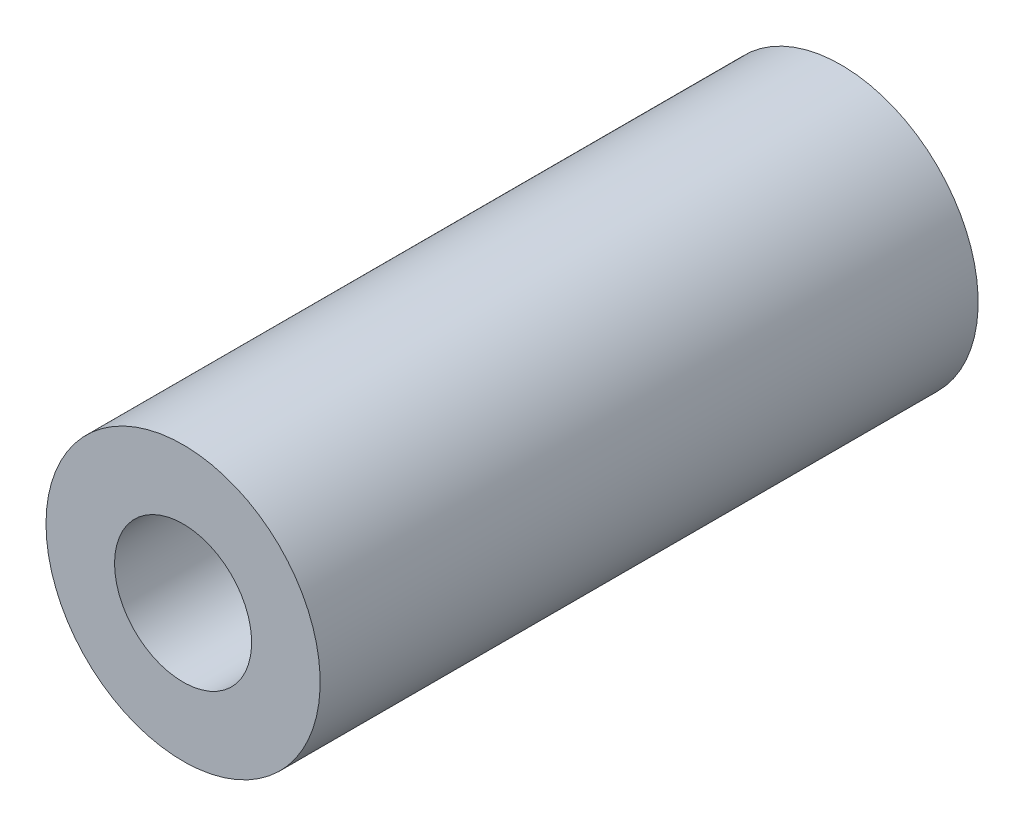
ISO-10303-21;
HEADER;
FILE_DESCRIPTION(('STEP AP214'),'2;1');
FILE_NAME('part.step','',(''),(''),'','','');
FILE_SCHEMA(('AUTOMOTIVE_DESIGN { 1 0 10303 214 1 1 1 1 }'));
ENDSEC;
DATA;
#1=APPLICATION_CONTEXT('core data for automotive mechanical design processes');
#2=APPLICATION_PROTOCOL_DEFINITION('international standard','automotive_design',2000,#1);
#3=PRODUCT_CONTEXT('',#1,'mechanical');
#4=PRODUCT('Part','Part','',(#3));
#5=PRODUCT_RELATED_PRODUCT_CATEGORY('part','',(#4));
#6=PRODUCT_DEFINITION_FORMATION('','',#4);
#7=PRODUCT_DEFINITION_CONTEXT('part definition',#1,'design');
#8=PRODUCT_DEFINITION('design','',#6,#7);
#9=PRODUCT_DEFINITION_SHAPE('','',#8);
#10=(LENGTH_UNIT() NAMED_UNIT(*) SI_UNIT(.MILLI.,.METRE.));
#11=(NAMED_UNIT(*) PLANE_ANGLE_UNIT() SI_UNIT($,.RADIAN.));
#12=(NAMED_UNIT(*) SI_UNIT($,.STERADIAN.) SOLID_ANGLE_UNIT());
#13=UNCERTAINTY_MEASURE_WITH_UNIT(LENGTH_MEASURE(1.E-05),#10,'distance_accuracy_value','');
#14=(GEOMETRIC_REPRESENTATION_CONTEXT(3) GLOBAL_UNCERTAINTY_ASSIGNED_CONTEXT((#13)) GLOBAL_UNIT_ASSIGNED_CONTEXT((#10,
#11,#12)) REPRESENTATION_CONTEXT('',''));
#15=CARTESIAN_POINT('',(0.,0.,0.));
#16=DIRECTION('',(0.,0.,1.));
#17=DIRECTION('',(1.,0.,0.));
#18=AXIS2_PLACEMENT_3D('',#15,#16,#17);
#19=CARTESIAN_POINT('',(0.,0.,30.48));
#20=DIRECTION('',(0.,0.,1.));
#21=DIRECTION('',(1.,0.,0.));
#22=AXIS2_PLACEMENT_3D('',#19,#20,#21);
#23=PLANE('',#22);
#24=CARTESIAN_POINT('',(0.,0.,30.48));
#25=DIRECTION('',(0.,0.,1.));
#26=DIRECTION('',(1.,0.,0.));
#27=AXIS2_PLACEMENT_3D('',#24,#25,#26);
#28=CIRCLE('',#27,6.35);
#29=CARTESIAN_POINT('',(-6.35,0.,30.48));
#30=VERTEX_POINT('',#29);
#31=EDGE_CURVE('E10',#30,#30,#28,.T.);
#32=ORIENTED_EDGE('',*,*,#31,.T.);
#33=EDGE_LOOP('',(#32));
#34=FACE_BOUND('',#33,.T.);
#35=CARTESIAN_POINT('',(0.,0.,30.48));
#36=DIRECTION('',(0.,0.,1.));
#37=DIRECTION('',(1.,0.,0.));
#38=AXIS2_PLACEMENT_3D('',#35,#36,#37);
#39=CIRCLE('',#38,3.175);
#40=CARTESIAN_POINT('',(-3.175,0.,30.48));
#41=VERTEX_POINT('',#40);
#42=EDGE_CURVE('E42',#41,#41,#39,.T.);
#43=ORIENTED_EDGE('',*,*,#42,.F.);
#44=EDGE_LOOP('',(#43));
#45=FACE_BOUND('',#44,.T.);
#46=ADVANCED_FACE('F31',(#34,#45),#23,.T.);
#47=CARTESIAN_POINT('',(0.,0.,0.));
#48=DIRECTION('',(0.,0.,1.));
#49=DIRECTION('',(1.,0.,0.));
#50=AXIS2_PLACEMENT_3D('',#47,#48,#49);
#51=PLANE('',#50);
#52=CARTESIAN_POINT('',(0.,0.,0.));
#53=DIRECTION('',(0.,0.,1.));
#54=DIRECTION('',(1.,0.,0.));
#55=AXIS2_PLACEMENT_3D('',#52,#53,#54);
#56=CIRCLE('',#55,6.35);
#57=CARTESIAN_POINT('',(-6.35,0.,0.));
#58=VERTEX_POINT('',#57);
#59=EDGE_CURVE('E35',#58,#58,#56,.T.);
#60=ORIENTED_EDGE('',*,*,#59,.F.);
#61=EDGE_LOOP('',(#60));
#62=FACE_BOUND('',#61,.T.);
#63=CARTESIAN_POINT('',(0.,0.,0.));
#64=DIRECTION('',(0.,0.,1.));
#65=DIRECTION('',(1.,0.,0.));
#66=AXIS2_PLACEMENT_3D('',#63,#64,#65);
#67=CIRCLE('',#66,3.175);
#68=CARTESIAN_POINT('',(-3.175,0.,0.));
#69=VERTEX_POINT('',#68);
#70=EDGE_CURVE('E44',#69,#69,#67,.T.);
#71=ORIENTED_EDGE('',*,*,#70,.T.);
#72=EDGE_LOOP('',(#71));
#73=FACE_BOUND('',#72,.T.);
#74=ADVANCED_FACE('F54',(#62,#73),#51,.F.);
#75=CARTESIAN_POINT('',(0.,0.,30.48));
#76=DIRECTION('',(0.,0.,-1.));
#77=DIRECTION('',(-1.,0.,0.));
#78=AXIS2_PLACEMENT_3D('',#75,#76,#77);
#79=CYLINDRICAL_SURFACE('',#78,6.35);
#80=CARTESIAN_POINT('',(-6.35,0.,30.48));
#81=CARTESIAN_POINT('',(-6.35,0.,30.1625));
#82=CARTESIAN_POINT('',(-6.35,0.,29.845));
#83=CARTESIAN_POINT('',(-6.35,0.,29.21));
#84=CARTESIAN_POINT('',(-6.35,0.,28.8925));
#85=CARTESIAN_POINT('',(-6.35,0.,28.2575));
#86=CARTESIAN_POINT('',(-6.35,0.,27.94));
#87=CARTESIAN_POINT('',(-6.35,0.,27.305));
#88=CARTESIAN_POINT('',(-6.35,0.,26.9875));
#89=CARTESIAN_POINT('',(-6.35,0.,26.3525));
#90=CARTESIAN_POINT('',(-6.35,0.,26.035));
#91=CARTESIAN_POINT('',(-6.35,0.,25.4));
#92=CARTESIAN_POINT('',(-6.35,0.,25.0825));
#93=CARTESIAN_POINT('',(-6.35,0.,24.4475));
#94=CARTESIAN_POINT('',(-6.35,0.,24.13));
#95=CARTESIAN_POINT('',(-6.35,0.,23.495));
#96=CARTESIAN_POINT('',(-6.35,0.,23.1775));
#97=CARTESIAN_POINT('',(-6.35,0.,22.5425));
#98=CARTESIAN_POINT('',(-6.35,0.,22.225));
#99=CARTESIAN_POINT('',(-6.35,0.,21.59));
#100=CARTESIAN_POINT('',(-6.35,0.,21.2725));
#101=CARTESIAN_POINT('',(-6.35,0.,20.6375));
#102=CARTESIAN_POINT('',(-6.35,0.,20.32));
#103=CARTESIAN_POINT('',(-6.35,0.,19.685));
#104=CARTESIAN_POINT('',(-6.35,0.,19.3675));
#105=CARTESIAN_POINT('',(-6.35,0.,18.7325));
#106=CARTESIAN_POINT('',(-6.35,0.,18.415));
#107=CARTESIAN_POINT('',(-6.35,0.,17.78));
#108=CARTESIAN_POINT('',(-6.35,0.,17.4625));
#109=CARTESIAN_POINT('',(-6.35,0.,16.8275));
#110=CARTESIAN_POINT('',(-6.35,0.,16.51));
#111=CARTESIAN_POINT('',(-6.35,0.,15.875));
#112=CARTESIAN_POINT('',(-6.35,0.,15.5575));
#113=CARTESIAN_POINT('',(-6.35,0.,14.9225));
#114=CARTESIAN_POINT('',(-6.35,0.,14.605));
#115=CARTESIAN_POINT('',(-6.35,0.,13.97));
#116=CARTESIAN_POINT('',(-6.35,0.,13.6525));
#117=CARTESIAN_POINT('',(-6.35,0.,13.0175));
#118=CARTESIAN_POINT('',(-6.35,0.,12.7));
#119=CARTESIAN_POINT('',(-6.35,0.,12.065));
#120=CARTESIAN_POINT('',(-6.35,0.,11.7475));
#121=CARTESIAN_POINT('',(-6.35,0.,11.1125));
#122=CARTESIAN_POINT('',(-6.35,0.,10.795));
#123=CARTESIAN_POINT('',(-6.35,0.,10.16));
#124=CARTESIAN_POINT('',(-6.35,0.,9.8425));
#125=CARTESIAN_POINT('',(-6.35,0.,9.2075));
#126=CARTESIAN_POINT('',(-6.35,0.,8.89));
#127=CARTESIAN_POINT('',(-6.35,0.,8.255));
#128=CARTESIAN_POINT('',(-6.35,0.,7.9375));
#129=CARTESIAN_POINT('',(-6.35,0.,7.3025));
#130=CARTESIAN_POINT('',(-6.35,0.,6.985));
#131=CARTESIAN_POINT('',(-6.35,0.,6.35));
#132=CARTESIAN_POINT('',(-6.35,0.,6.0325));
#133=CARTESIAN_POINT('',(-6.35,0.,5.3975));
#134=CARTESIAN_POINT('',(-6.35,0.,5.08));
#135=CARTESIAN_POINT('',(-6.35,0.,4.445));
#136=CARTESIAN_POINT('',(-6.35,0.,4.1275));
#137=CARTESIAN_POINT('',(-6.35,0.,3.4925));
#138=CARTESIAN_POINT('',(-6.35,0.,3.175));
#139=CARTESIAN_POINT('',(-6.35,0.,2.54));
#140=CARTESIAN_POINT('',(-6.35,0.,2.2225));
#141=CARTESIAN_POINT('',(-6.35,0.,1.5875));
#142=CARTESIAN_POINT('',(-6.35,0.,1.27));
#143=CARTESIAN_POINT('',(-6.35,0.,0.634999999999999));
#144=CARTESIAN_POINT('',(-6.35,0.,0.3175));
#145=CARTESIAN_POINT('',(-6.35,0.,0.));
#146=B_SPLINE_CURVE_WITH_KNOTS('',3,(#80,#81,#82,#83,#84,#85,#86,#87,#88,#89,#90,#91,#92,#93,
#94,#95,#96,#97,#98,#99,#100,#101,#102,#103,#104,#105,#106,#107,#108,#109,#110,#111,#112,#113,
#114,#115,#116,#117,#118,#119,#120,#121,#122,#123,#124,#125,#126,#127,#128,#129,#130,#131,#132,
#133,#134,#135,#136,#137,#138,#139,#140,#141,#142,#143,#144,#145),.UNSPECIFIED.,.F.,.F.,(4,2,2,
2,2,2,2,2,2,2,2,2,2,2,2,2,2,2,2,2,2,2,2,2,2,2,2,2,2,2,2,2,4),(0.,0.952499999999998,1.905,2.8575,
3.81,4.7625,5.715,6.6675,7.61999999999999,8.5725,9.525,10.4775,11.43,12.3825,13.335,14.2875,
15.24,16.1925,17.145,18.0975,19.05,20.0025,20.955,21.9075,22.86,23.8125,24.765,25.7175,26.67,
27.6225,28.575,29.5275,30.48),.UNSPECIFIED.);
#147=EDGE_CURVE('BSEAM33',#30,#58,#146,.T.);
#148=ORIENTED_EDGE('',*,*,#31,.F.);
#149=ORIENTED_EDGE('',*,*,#59,.T.);
#150=ORIENTED_EDGE('',*,*,#147,.T.);
#151=ORIENTED_EDGE('',*,*,#147,.F.);
#152=EDGE_LOOP('',(#148,#150,#149,#151));
#153=FACE_BOUND('',#152,.T.);
#154=ADVANCED_FACE('F33',(#153),#79,.T.);
#155=CARTESIAN_POINT('',(0.,0.,30.48));
#156=DIRECTION('',(0.,0.,-1.));
#157=DIRECTION('',(-1.,0.,0.));
#158=AXIS2_PLACEMENT_3D('',#155,#156,#157);
#159=CYLINDRICAL_SURFACE('',#158,3.175);
#160=CARTESIAN_POINT('',(-3.175,0.,30.48));
#161=CARTESIAN_POINT('',(-3.175,0.,30.1625));
#162=CARTESIAN_POINT('',(-3.175,0.,29.845));
#163=CARTESIAN_POINT('',(-3.175,0.,29.21));
#164=CARTESIAN_POINT('',(-3.175,0.,28.8925));
#165=CARTESIAN_POINT('',(-3.175,0.,28.2575));
#166=CARTESIAN_POINT('',(-3.175,0.,27.94));
#167=CARTESIAN_POINT('',(-3.175,0.,27.305));
#168=CARTESIAN_POINT('',(-3.175,0.,26.9875));
#169=CARTESIAN_POINT('',(-3.175,0.,26.3525));
#170=CARTESIAN_POINT('',(-3.175,0.,26.035));
#171=CARTESIAN_POINT('',(-3.175,0.,25.4));
#172=CARTESIAN_POINT('',(-3.175,0.,25.0825));
#173=CARTESIAN_POINT('',(-3.175,0.,24.4475));
#174=CARTESIAN_POINT('',(-3.175,0.,24.13));
#175=CARTESIAN_POINT('',(-3.175,0.,23.495));
#176=CARTESIAN_POINT('',(-3.175,0.,23.1775));
#177=CARTESIAN_POINT('',(-3.175,0.,22.5425));
#178=CARTESIAN_POINT('',(-3.175,0.,22.225));
#179=CARTESIAN_POINT('',(-3.175,0.,21.59));
#180=CARTESIAN_POINT('',(-3.175,0.,21.2725));
#181=CARTESIAN_POINT('',(-3.175,0.,20.6375));
#182=CARTESIAN_POINT('',(-3.175,0.,20.32));
#183=CARTESIAN_POINT('',(-3.175,0.,19.685));
#184=CARTESIAN_POINT('',(-3.175,0.,19.3675));
#185=CARTESIAN_POINT('',(-3.175,0.,18.7325));
#186=CARTESIAN_POINT('',(-3.175,0.,18.415));
#187=CARTESIAN_POINT('',(-3.175,0.,17.78));
#188=CARTESIAN_POINT('',(-3.175,0.,17.4625));
#189=CARTESIAN_POINT('',(-3.175,0.,16.8275));
#190=CARTESIAN_POINT('',(-3.175,0.,16.51));
#191=CARTESIAN_POINT('',(-3.175,0.,15.875));
#192=CARTESIAN_POINT('',(-3.175,0.,15.5575));
#193=CARTESIAN_POINT('',(-3.175,0.,14.9225));
#194=CARTESIAN_POINT('',(-3.175,0.,14.605));
#195=CARTESIAN_POINT('',(-3.175,0.,13.97));
#196=CARTESIAN_POINT('',(-3.175,0.,13.6525));
#197=CARTESIAN_POINT('',(-3.175,0.,13.0175));
#198=CARTESIAN_POINT('',(-3.175,0.,12.7));
#199=CARTESIAN_POINT('',(-3.175,0.,12.065));
#200=CARTESIAN_POINT('',(-3.175,0.,11.7475));
#201=CARTESIAN_POINT('',(-3.175,0.,11.1125));
#202=CARTESIAN_POINT('',(-3.175,0.,10.795));
#203=CARTESIAN_POINT('',(-3.175,0.,10.16));
#204=CARTESIAN_POINT('',(-3.175,0.,9.8425));
#205=CARTESIAN_POINT('',(-3.175,0.,9.2075));
#206=CARTESIAN_POINT('',(-3.175,0.,8.89));
#207=CARTESIAN_POINT('',(-3.175,0.,8.255));
#208=CARTESIAN_POINT('',(-3.175,0.,7.9375));
#209=CARTESIAN_POINT('',(-3.175,0.,7.3025));
#210=CARTESIAN_POINT('',(-3.175,0.,6.985));
#211=CARTESIAN_POINT('',(-3.175,0.,6.35));
#212=CARTESIAN_POINT('',(-3.175,0.,6.0325));
#213=CARTESIAN_POINT('',(-3.175,0.,5.3975));
#214=CARTESIAN_POINT('',(-3.175,0.,5.08));
#215=CARTESIAN_POINT('',(-3.175,0.,4.445));
#216=CARTESIAN_POINT('',(-3.175,0.,4.1275));
#217=CARTESIAN_POINT('',(-3.175,0.,3.4925));
#218=CARTESIAN_POINT('',(-3.175,0.,3.175));
#219=CARTESIAN_POINT('',(-3.175,0.,2.54));
#220=CARTESIAN_POINT('',(-3.175,0.,2.2225));
#221=CARTESIAN_POINT('',(-3.175,0.,1.5875));
#222=CARTESIAN_POINT('',(-3.175,0.,1.27));
#223=CARTESIAN_POINT('',(-3.175,0.,0.634999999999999));
#224=CARTESIAN_POINT('',(-3.175,0.,0.3175));
#225=CARTESIAN_POINT('',(-3.175,0.,0.));
#226=B_SPLINE_CURVE_WITH_KNOTS('',3,(#160,#161,#162,#163,#164,#165,#166,#167,#168,#169,#170,
#171,#172,#173,#174,#175,#176,#177,#178,#179,#180,#181,#182,#183,#184,#185,#186,#187,#188,#189,
#190,#191,#192,#193,#194,#195,#196,#197,#198,#199,#200,#201,#202,#203,#204,#205,#206,#207,#208,
#209,#210,#211,#212,#213,#214,#215,#216,#217,#218,#219,#220,#221,#222,#223,#224,#225),
.UNSPECIFIED.,.F.,.F.,(4,2,2,2,2,2,2,2,2,2,2,2,2,2,2,2,2,2,2,2,2,2,2,2,2,2,2,2,2,2,2,2,4),(0.,
0.952499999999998,1.905,2.8575,3.81,4.7625,5.715,6.6675,7.61999999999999,8.5725,9.525,10.4775,
11.43,12.3825,13.335,14.2875,15.24,16.1925,17.145,18.0975,19.05,20.0025,20.955,21.9075,22.86,
23.8125,24.765,25.7175,26.67,27.6225,28.575,29.5275,30.48),.UNSPECIFIED.);
#227=EDGE_CURVE('BSEAM50',#41,#69,#226,.T.);
#228=ORIENTED_EDGE('',*,*,#42,.T.);
#229=ORIENTED_EDGE('',*,*,#70,.F.);
#230=ORIENTED_EDGE('',*,*,#227,.T.);
#231=ORIENTED_EDGE('',*,*,#227,.F.);
#232=EDGE_LOOP('',(#228,#230,#229,#231));
#233=FACE_BOUND('',#232,.T.);
#234=ADVANCED_FACE('F50',(#233),#159,.F.);
#235=CLOSED_SHELL('',(#46,#74,#154,#234));
#236=MANIFOLD_SOLID_BREP('B2',#235);
#237=ADVANCED_BREP_SHAPE_REPRESENTATION('',(#18,#236),#14);
#238=SHAPE_DEFINITION_REPRESENTATION(#9,#237);
ENDSEC;
END-ISO-10303-21;
